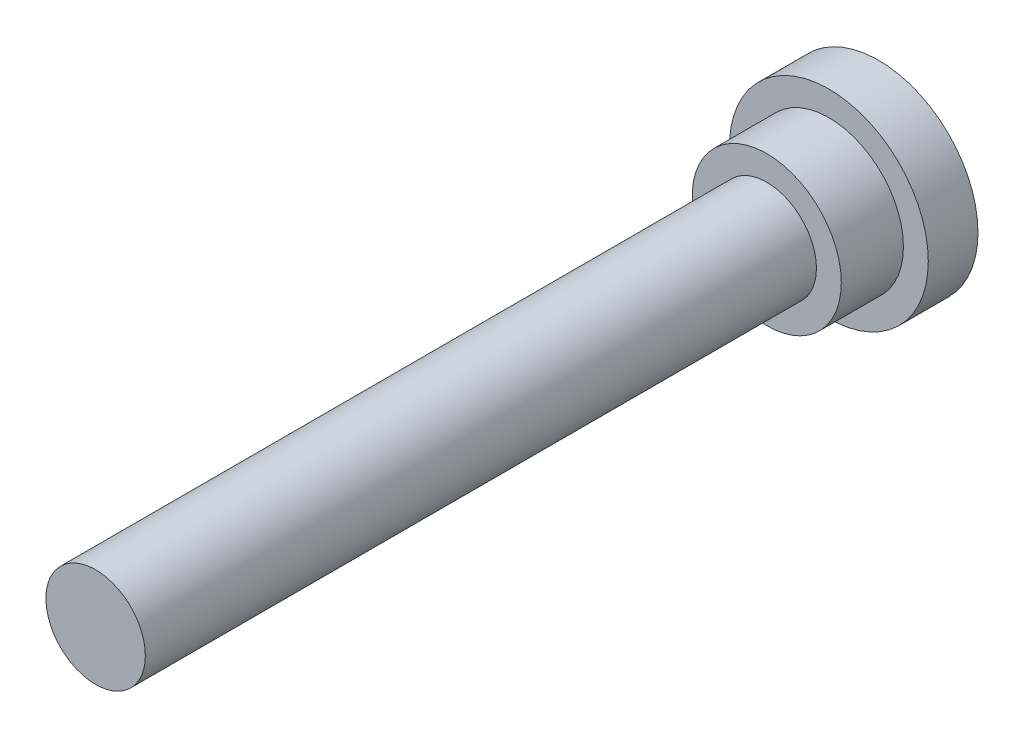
ISO-10303-21;
HEADER;
FILE_DESCRIPTION(('STEP AP214'),'2;1');
FILE_NAME('part.step','',(''),(''),'','','');
FILE_SCHEMA(('AUTOMOTIVE_DESIGN { 1 0 10303 214 1 1 1 1 }'));
ENDSEC;
DATA;
#1=APPLICATION_CONTEXT('core data for automotive mechanical design processes');
#2=APPLICATION_PROTOCOL_DEFINITION('international standard','automotive_design',2000,#1);
#3=PRODUCT_CONTEXT('',#1,'mechanical');
#4=PRODUCT('Part','Part','',(#3));
#5=PRODUCT_RELATED_PRODUCT_CATEGORY('part','',(#4));
#6=PRODUCT_DEFINITION_FORMATION('','',#4);
#7=PRODUCT_DEFINITION_CONTEXT('part definition',#1,'design');
#8=PRODUCT_DEFINITION('design','',#6,#7);
#9=PRODUCT_DEFINITION_SHAPE('','',#8);
#10=(LENGTH_UNIT() NAMED_UNIT(*) SI_UNIT(.MILLI.,.METRE.));
#11=(NAMED_UNIT(*) PLANE_ANGLE_UNIT() SI_UNIT($,.RADIAN.));
#12=(NAMED_UNIT(*) SI_UNIT($,.STERADIAN.) SOLID_ANGLE_UNIT());
#13=UNCERTAINTY_MEASURE_WITH_UNIT(LENGTH_MEASURE(1.E-05),#10,'distance_accuracy_value','');
#14=(GEOMETRIC_REPRESENTATION_CONTEXT(3) GLOBAL_UNCERTAINTY_ASSIGNED_CONTEXT((#13)) GLOBAL_UNIT_ASSIGNED_CONTEXT((#10,
#11,#12)) REPRESENTATION_CONTEXT('',''));
#15=CARTESIAN_POINT('',(0.,0.,0.));
#16=DIRECTION('',(0.,0.,1.));
#17=DIRECTION('',(1.,0.,0.));
#18=AXIS2_PLACEMENT_3D('',#15,#16,#17);
#19=CARTESIAN_POINT('',(0.,0.,63.));
#20=DIRECTION('',(0.,0.,1.));
#21=DIRECTION('',(1.,0.,0.));
#22=AXIS2_PLACEMENT_3D('',#19,#20,#21);
#23=PLANE('',#22);
#24=CARTESIAN_POINT('',(0.,0.,63.));
#25=DIRECTION('',(0.,0.,1.));
#26=DIRECTION('',(1.,0.,0.));
#27=AXIS2_PLACEMENT_3D('',#24,#25,#26);
#28=CIRCLE('',#27,4.);
#29=CARTESIAN_POINT('',(4.,0.,63.));
#30=VERTEX_POINT('',#29);
#31=EDGE_CURVE('E8',#30,#30,#28,.T.);
#32=ORIENTED_EDGE('',*,*,#31,.T.);
#33=EDGE_LOOP('',(#32));
#34=FACE_BOUND('',#33,.T.);
#35=ADVANCED_FACE('F12',(#34),#23,.T.);
#36=CARTESIAN_POINT('',(0.,0.,30.));
#37=DIRECTION('',(0.,0.,1.));
#38=DIRECTION('',(1.,0.,0.));
#39=AXIS2_PLACEMENT_3D('',#36,#37,#38);
#40=CYLINDRICAL_SURFACE('',#39,4.);
#41=CARTESIAN_POINT('',(0.,0.,9.));
#42=DIRECTION('',(0.,0.,1.));
#43=DIRECTION('',(1.,0.,0.));
#44=AXIS2_PLACEMENT_3D('',#41,#42,#43);
#45=CIRCLE('',#44,4.);
#46=CARTESIAN_POINT('',(4.,0.,9.));
#47=VERTEX_POINT('',#46);
#48=EDGE_CURVE('E18',#47,#47,#45,.T.);
#49=ORIENTED_EDGE('',*,*,#48,.T.);
#50=EDGE_LOOP('',(#49));
#51=FACE_BOUND('',#50,.T.);
#52=ORIENTED_EDGE('',*,*,#31,.F.);
#53=EDGE_LOOP('',(#52));
#54=FACE_BOUND('',#53,.T.);
#55=ADVANCED_FACE('F51',(#51,#54),#40,.T.);
#56=CARTESIAN_POINT('',(-4.,0.,9.));
#57=DIRECTION('',(0.,0.,1.));
#58=DIRECTION('',(1.,0.,0.));
#59=AXIS2_PLACEMENT_3D('',#56,#57,#58);
#60=PLANE('',#59);
#61=CARTESIAN_POINT('',(0.,0.,9.));
#62=DIRECTION('',(0.,0.,1.));
#63=DIRECTION('',(1.,0.,0.));
#64=AXIS2_PLACEMENT_3D('',#61,#62,#63);
#65=CIRCLE('',#64,6.);
#66=CARTESIAN_POINT('',(6.,0.,9.));
#67=VERTEX_POINT('',#66);
#68=EDGE_CURVE('E22',#67,#67,#65,.T.);
#69=ORIENTED_EDGE('',*,*,#68,.T.);
#70=EDGE_LOOP('',(#69));
#71=FACE_BOUND('',#70,.T.);
#72=ORIENTED_EDGE('',*,*,#48,.F.);
#73=EDGE_LOOP('',(#72));
#74=FACE_BOUND('',#73,.T.);
#75=ADVANCED_FACE('F55',(#71,#74),#60,.T.);
#76=CARTESIAN_POINT('',(0.,0.,30.));
#77=DIRECTION('',(0.,0.,1.));
#78=DIRECTION('',(1.,0.,0.));
#79=AXIS2_PLACEMENT_3D('',#76,#77,#78);
#80=CYLINDRICAL_SURFACE('',#79,6.);
#81=CARTESIAN_POINT('',(0.,0.,4.));
#82=DIRECTION('',(0.,0.,1.));
#83=DIRECTION('',(1.,0.,0.));
#84=AXIS2_PLACEMENT_3D('',#81,#82,#83);
#85=CIRCLE('',#84,6.);
#86=CARTESIAN_POINT('',(6.,0.,4.));
#87=VERTEX_POINT('',#86);
#88=EDGE_CURVE('E26',#87,#87,#85,.T.);
#89=ORIENTED_EDGE('',*,*,#88,.T.);
#90=EDGE_LOOP('',(#89));
#91=FACE_BOUND('',#90,.T.);
#92=ORIENTED_EDGE('',*,*,#68,.F.);
#93=EDGE_LOOP('',(#92));
#94=FACE_BOUND('',#93,.T.);
#95=ADVANCED_FACE('F59',(#91,#94),#80,.T.);
#96=CARTESIAN_POINT('',(-6.,0.,4.));
#97=DIRECTION('',(0.,0.,1.));
#98=DIRECTION('',(1.,0.,0.));
#99=AXIS2_PLACEMENT_3D('',#96,#97,#98);
#100=PLANE('',#99);
#101=CARTESIAN_POINT('',(0.,0.,4.));
#102=DIRECTION('',(0.,0.,1.));
#103=DIRECTION('',(1.,0.,0.));
#104=AXIS2_PLACEMENT_3D('',#101,#102,#103);
#105=CIRCLE('',#104,8.);
#106=CARTESIAN_POINT('',(8.,0.,4.));
#107=VERTEX_POINT('',#106);
#108=EDGE_CURVE('E31',#107,#107,#105,.T.);
#109=ORIENTED_EDGE('',*,*,#108,.T.);
#110=EDGE_LOOP('',(#109));
#111=FACE_BOUND('',#110,.T.);
#112=ORIENTED_EDGE('',*,*,#88,.F.);
#113=EDGE_LOOP('',(#112));
#114=FACE_BOUND('',#113,.T.);
#115=ADVANCED_FACE('F48',(#111,#114),#100,.T.);
#116=CARTESIAN_POINT('',(0.,0.,30.));
#117=DIRECTION('',(0.,0.,1.));
#118=DIRECTION('',(1.,0.,0.));
#119=AXIS2_PLACEMENT_3D('',#116,#117,#118);
#120=CYLINDRICAL_SURFACE('',#119,8.);
#121=CARTESIAN_POINT('',(0.,0.,0.));
#122=DIRECTION('',(0.,0.,1.));
#123=DIRECTION('',(1.,0.,0.));
#124=AXIS2_PLACEMENT_3D('',#121,#122,#123);
#125=CIRCLE('',#124,8.);
#126=CARTESIAN_POINT('',(8.,0.,0.));
#127=VERTEX_POINT('',#126);
#128=EDGE_CURVE('E34',#127,#127,#125,.T.);
#129=ORIENTED_EDGE('',*,*,#128,.T.);
#130=EDGE_LOOP('',(#129));
#131=FACE_BOUND('',#130,.T.);
#132=ORIENTED_EDGE('',*,*,#108,.F.);
#133=EDGE_LOOP('',(#132));
#134=FACE_BOUND('',#133,.T.);
#135=ADVANCED_FACE('F38',(#131,#134),#120,.T.);
#136=CARTESIAN_POINT('',(-8.,0.,0.));
#137=DIRECTION('',(0.,0.,-1.));
#138=DIRECTION('',(-1.,0.,0.));
#139=AXIS2_PLACEMENT_3D('',#136,#137,#138);
#140=PLANE('',#139);
#141=ORIENTED_EDGE('',*,*,#128,.F.);
#142=EDGE_LOOP('',(#141));
#143=FACE_BOUND('',#142,.T.);
#144=ADVANCED_FACE('F41',(#143),#140,.T.);
#145=CLOSED_SHELL('',(#35,#55,#75,#95,#115,#135,#144));
#146=MANIFOLD_SOLID_BREP('B1',#145);
#147=ADVANCED_BREP_SHAPE_REPRESENTATION('',(#18,#146),#14);
#148=SHAPE_DEFINITION_REPRESENTATION(#9,#147);
ENDSEC;
END-ISO-10303-21;
